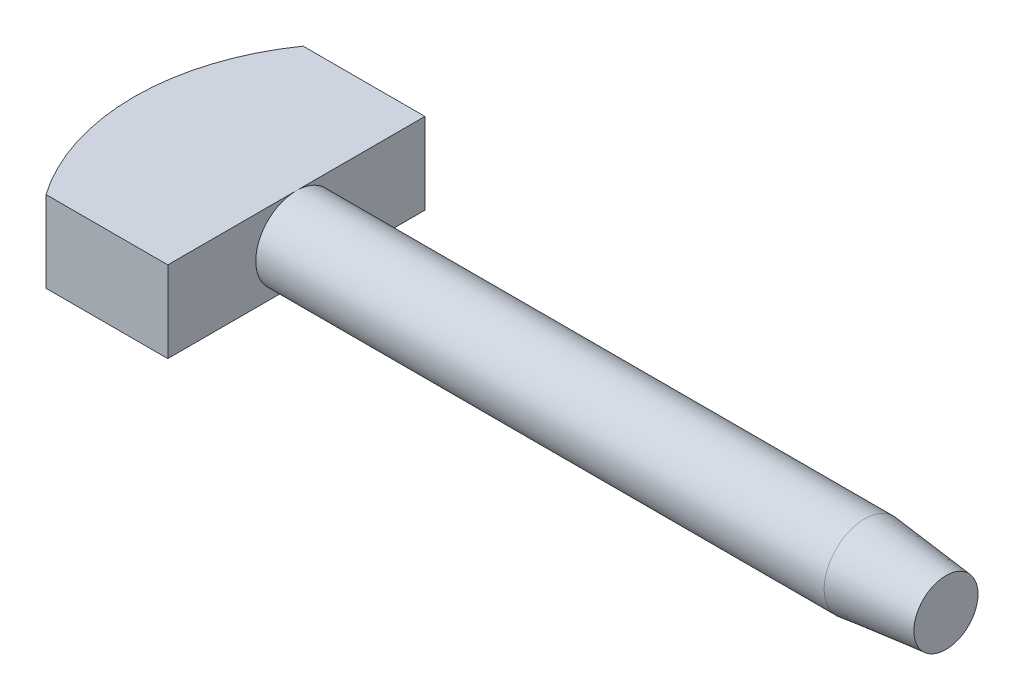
ISO-10303-21;
HEADER;
FILE_DESCRIPTION(('STEP AP214'),'2;1');
FILE_NAME('part.step','',(''),(''),'','','');
FILE_SCHEMA(('AUTOMOTIVE_DESIGN { 1 0 10303 214 1 1 1 1 }'));
ENDSEC;
DATA;
#1=APPLICATION_CONTEXT('core data for automotive mechanical design processes');
#2=APPLICATION_PROTOCOL_DEFINITION('international standard','automotive_design',2000,#1);
#3=PRODUCT_CONTEXT('',#1,'mechanical');
#4=PRODUCT('Part','Part','',(#3));
#5=PRODUCT_RELATED_PRODUCT_CATEGORY('part','',(#4));
#6=PRODUCT_DEFINITION_FORMATION('','',#4);
#7=PRODUCT_DEFINITION_CONTEXT('part definition',#1,'design');
#8=PRODUCT_DEFINITION('design','',#6,#7);
#9=PRODUCT_DEFINITION_SHAPE('','',#8);
#10=(LENGTH_UNIT() NAMED_UNIT(*) SI_UNIT(.MILLI.,.METRE.));
#11=(NAMED_UNIT(*) PLANE_ANGLE_UNIT() SI_UNIT($,.RADIAN.));
#12=(NAMED_UNIT(*) SI_UNIT($,.STERADIAN.) SOLID_ANGLE_UNIT());
#13=UNCERTAINTY_MEASURE_WITH_UNIT(LENGTH_MEASURE(1.E-05),#10,'distance_accuracy_value','');
#14=(GEOMETRIC_REPRESENTATION_CONTEXT(3) GLOBAL_UNCERTAINTY_ASSIGNED_CONTEXT((#13)) GLOBAL_UNIT_ASSIGNED_CONTEXT((#10,
#11,#12)) REPRESENTATION_CONTEXT('',''));
#15=CARTESIAN_POINT('',(0.,0.,0.));
#16=DIRECTION('',(0.,0.,1.));
#17=DIRECTION('',(1.,0.,0.));
#18=AXIS2_PLACEMENT_3D('',#15,#16,#17);
#19=CARTESIAN_POINT('',(24.,0.,0.));
#20=DIRECTION('',(-1.,0.,0.));
#21=DIRECTION('',(0.,0.,1.));
#22=AXIS2_PLACEMENT_3D('',#19,#20,#21);
#23=CYLINDRICAL_SURFACE('',#22,1.5);
#24=CARTESIAN_POINT('',(20.9999999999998,0.,0.));
#25=DIRECTION('',(1.,0.,0.));
#26=DIRECTION('',(0.,0.,-1.));
#27=AXIS2_PLACEMENT_3D('',#24,#25,#26);
#28=CIRCLE('',#27,1.5);
#29=CARTESIAN_POINT('',(20.9999999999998,0.,-1.5));
#30=VERTEX_POINT('',#29);
#31=EDGE_CURVE('E11',#30,#30,#28,.F.);
#32=ORIENTED_EDGE('',*,*,#31,.T.);
#33=EDGE_LOOP('',(#32));
#34=FACE_BOUND('',#33,.T.);
#35=CARTESIAN_POINT('',(0.,0.,0.));
#36=DIRECTION('',(1.,0.,0.));
#37=DIRECTION('',(0.,0.,-1.));
#38=AXIS2_PLACEMENT_3D('',#35,#36,#37);
#39=CIRCLE('',#38,1.5);
#40=CARTESIAN_POINT('',(0.,1.5,0.));
#41=VERTEX_POINT('',#40);
#42=CARTESIAN_POINT('',(0.,-1.5,0.));
#43=VERTEX_POINT('',#42);
#44=EDGE_CURVE('E118',#41,#43,#39,.T.);
#45=ORIENTED_EDGE('',*,*,#44,.T.);
#46=EDGE_CURVE('E53',#43,#41,#39,.T.);
#47=ORIENTED_EDGE('',*,*,#46,.T.);
#48=EDGE_LOOP('',(#45,#47));
#49=FACE_BOUND('',#48,.T.);
#50=ADVANCED_FACE('F31',(#34,#49),#23,.T.);
#51=CARTESIAN_POINT('',(24.,0.,0.));
#52=DIRECTION('',(1.,0.,0.));
#53=DIRECTION('',(0.,0.,-1.));
#54=AXIS2_PLACEMENT_3D('',#51,#52,#53);
#55=PLANE('',#54);
#56=CARTESIAN_POINT('',(24.,0.,0.));
#57=DIRECTION('',(1.,0.,0.));
#58=DIRECTION('',(0.,0.,-1.));
#59=AXIS2_PLACEMENT_3D('',#56,#57,#58);
#60=CIRCLE('',#59,1.18468729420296);
#61=CARTESIAN_POINT('',(24.,0.,-1.18468729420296));
#62=VERTEX_POINT('',#61);
#63=EDGE_CURVE('E39',#62,#62,#60,.T.);
#64=ORIENTED_EDGE('',*,*,#63,.T.);
#65=EDGE_LOOP('',(#64));
#66=FACE_BOUND('',#65,.T.);
#67=ADVANCED_FACE('F123',(#66),#55,.T.);
#68=CARTESIAN_POINT('',(24.,0.,0.));
#69=DIRECTION('',(-1.,0.,0.));
#70=DIRECTION('',(0.,0.,1.));
#71=AXIS2_PLACEMENT_3D('',#68,#69,#70);
#72=CONICAL_SURFACE('',#71,1.18468729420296,0.104719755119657);
#73=ORIENTED_EDGE('',*,*,#31,.F.);
#74=EDGE_LOOP('',(#73));
#75=FACE_BOUND('',#74,.T.);
#76=ORIENTED_EDGE('',*,*,#63,.F.);
#77=EDGE_LOOP('',(#76));
#78=FACE_BOUND('',#77,.T.);
#79=ADVANCED_FACE('F33',(#75,#78),#72,.T.);
#80=CARTESIAN_POINT('',(0.,-1.5,-4.75));
#81=DIRECTION('',(1.,0.,0.));
#82=DIRECTION('',(0.,0.,-1.));
#83=AXIS2_PLACEMENT_3D('',#80,#81,#82);
#84=PLANE('',#83);
#85=ORIENTED_EDGE('',*,*,#44,.F.);
#86=DIRECTION('',(0.,0.,-1.));
#87=VECTOR('',#86,1.);
#88=CARTESIAN_POINT('',(0.,1.5,-4.75));
#89=LINE('',#88,#87);
#90=CARTESIAN_POINT('',(0.,1.5,4.75));
#91=VERTEX_POINT('',#90);
#92=EDGE_CURVE('E46',#91,#41,#89,.T.);
#93=ORIENTED_EDGE('',*,*,#92,.F.);
#94=DIRECTION('',(0.,1.,0.));
#95=VECTOR('',#94,1.);
#96=CARTESIAN_POINT('',(0.,-1.5,4.75));
#97=LINE('',#96,#95);
#98=CARTESIAN_POINT('',(0.,-1.5,4.75));
#99=VERTEX_POINT('',#98);
#100=EDGE_CURVE('E113',#99,#91,#97,.T.);
#101=ORIENTED_EDGE('',*,*,#100,.F.);
#102=DIRECTION('',(0.,0.,-1.));
#103=VECTOR('',#102,1.);
#104=CARTESIAN_POINT('',(0.,-1.5,-4.75));
#105=LINE('',#104,#103);
#106=EDGE_CURVE('E103',#99,#43,#105,.T.);
#107=ORIENTED_EDGE('',*,*,#106,.T.);
#108=EDGE_LOOP('',(#85,#93,#101,#107));
#109=FACE_BOUND('',#108,.T.);
#110=ADVANCED_FACE('F126',(#109),#84,.T.);
#111=ORIENTED_EDGE('',*,*,#46,.F.);
#112=CARTESIAN_POINT('',(0.,-1.5,-4.75));
#113=VERTEX_POINT('',#112);
#114=EDGE_CURVE('E89',#43,#113,#105,.T.);
#115=ORIENTED_EDGE('',*,*,#114,.T.);
#116=DIRECTION('',(0.,1.,0.));
#117=VECTOR('',#116,1.);
#118=CARTESIAN_POINT('',(0.,-1.5,-4.75));
#119=LINE('',#118,#117);
#120=CARTESIAN_POINT('',(0.,1.5,-4.75));
#121=VERTEX_POINT('',#120);
#122=EDGE_CURVE('E87',#113,#121,#119,.T.);
#123=ORIENTED_EDGE('',*,*,#122,.T.);
#124=EDGE_CURVE('E77',#41,#121,#89,.T.);
#125=ORIENTED_EDGE('',*,*,#124,.F.);
#126=EDGE_LOOP('',(#111,#115,#123,#125));
#127=FACE_BOUND('',#126,.T.);
#128=ADVANCED_FACE('F88',(#127),#84,.T.);
#129=CARTESIAN_POINT('',(0.,-1.5,4.75));
#130=DIRECTION('',(0.,0.,1.));
#131=DIRECTION('',(1.,0.,0.));
#132=AXIS2_PLACEMENT_3D('',#129,#130,#131);
#133=PLANE('',#132);
#134=ORIENTED_EDGE('',*,*,#100,.T.);
#135=DIRECTION('',(1.,0.,0.));
#136=VECTOR('',#135,1.);
#137=CARTESIAN_POINT('',(0.,1.5,4.75));
#138=LINE('',#137,#136);
#139=CARTESIAN_POINT('',(-4.5,1.5,4.75));
#140=VERTEX_POINT('',#139);
#141=EDGE_CURVE('E99',#140,#91,#138,.T.);
#142=ORIENTED_EDGE('',*,*,#141,.F.);
#143=DIRECTION('',(0.,1.,0.));
#144=VECTOR('',#143,1.);
#145=CARTESIAN_POINT('',(-4.5,-1.5,4.75));
#146=LINE('',#145,#144);
#147=CARTESIAN_POINT('',(-4.5,-1.5,4.75));
#148=VERTEX_POINT('',#147);
#149=EDGE_CURVE('E115',#148,#140,#146,.T.);
#150=ORIENTED_EDGE('',*,*,#149,.F.);
#151=DIRECTION('',(1.,0.,0.));
#152=VECTOR('',#151,1.);
#153=CARTESIAN_POINT('',(0.,-1.5,4.75));
#154=LINE('',#153,#152);
#155=EDGE_CURVE('E94',#148,#99,#154,.T.);
#156=ORIENTED_EDGE('',*,*,#155,.T.);
#157=EDGE_LOOP('',(#134,#142,#150,#156));
#158=FACE_BOUND('',#157,.T.);
#159=ADVANCED_FACE('F148',(#158),#133,.T.);
#160=CARTESIAN_POINT('',(2.27083333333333,-1.5,0.));
#161=DIRECTION('',(0.,1.,0.));
#162=DIRECTION('',(0.,0.,1.));
#163=AXIS2_PLACEMENT_3D('',#160,#161,#162);
#164=CYLINDRICAL_SURFACE('',#163,8.27083333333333);
#165=ORIENTED_EDGE('',*,*,#149,.T.);
#166=CARTESIAN_POINT('',(2.27083333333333,1.5,0.));
#167=DIRECTION('',(0.,1.,0.));
#168=DIRECTION('',(0.,0.,1.));
#169=AXIS2_PLACEMENT_3D('',#166,#167,#168);
#170=CIRCLE('',#169,8.27083333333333);
#171=CARTESIAN_POINT('',(-4.5,1.5,-4.75));
#172=VERTEX_POINT('',#171);
#173=EDGE_CURVE('E97',#172,#140,#170,.T.);
#174=ORIENTED_EDGE('',*,*,#173,.F.);
#175=DIRECTION('',(0.,1.,0.));
#176=VECTOR('',#175,1.);
#177=CARTESIAN_POINT('',(-4.5,-1.5,-4.75));
#178=LINE('',#177,#176);
#179=CARTESIAN_POINT('',(-4.5,-1.5,-4.75));
#180=VERTEX_POINT('',#179);
#181=EDGE_CURVE('E93',#180,#172,#178,.T.);
#182=ORIENTED_EDGE('',*,*,#181,.F.);
#183=CARTESIAN_POINT('',(2.27083333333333,-1.5,0.));
#184=DIRECTION('',(0.,1.,0.));
#185=DIRECTION('',(0.,0.,1.));
#186=AXIS2_PLACEMENT_3D('',#183,#184,#185);
#187=CIRCLE('',#186,8.27083333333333);
#188=EDGE_CURVE('E108',#180,#148,#187,.T.);
#189=ORIENTED_EDGE('',*,*,#188,.T.);
#190=EDGE_LOOP('',(#165,#174,#182,#189));
#191=FACE_BOUND('',#190,.T.);
#192=ADVANCED_FACE('F145',(#191),#164,.T.);
#193=CARTESIAN_POINT('',(0.,-1.5,-4.75));
#194=DIRECTION('',(0.,0.,-1.));
#195=DIRECTION('',(-1.,0.,0.));
#196=AXIS2_PLACEMENT_3D('',#193,#194,#195);
#197=PLANE('',#196);
#198=ORIENTED_EDGE('',*,*,#181,.T.);
#199=DIRECTION('',(-1.,0.,0.));
#200=VECTOR('',#199,1.);
#201=CARTESIAN_POINT('',(0.,1.5,-4.75));
#202=LINE('',#201,#200);
#203=EDGE_CURVE('E82',#121,#172,#202,.T.);
#204=ORIENTED_EDGE('',*,*,#203,.F.);
#205=ORIENTED_EDGE('',*,*,#122,.F.);
#206=DIRECTION('',(-1.,0.,0.));
#207=VECTOR('',#206,1.);
#208=CARTESIAN_POINT('',(0.,-1.5,-4.75));
#209=LINE('',#208,#207);
#210=EDGE_CURVE('E106',#113,#180,#209,.T.);
#211=ORIENTED_EDGE('',*,*,#210,.T.);
#212=EDGE_LOOP('',(#198,#204,#205,#211));
#213=FACE_BOUND('',#212,.T.);
#214=ADVANCED_FACE('F96',(#213),#197,.T.);
#215=CARTESIAN_POINT('',(2.27083333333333,-1.5,0.));
#216=DIRECTION('',(0.,1.,0.));
#217=DIRECTION('',(0.,0.,1.));
#218=AXIS2_PLACEMENT_3D('',#215,#216,#217);
#219=PLANE('',#218);
#220=ORIENTED_EDGE('',*,*,#106,.F.);
#221=ORIENTED_EDGE('',*,*,#155,.F.);
#222=ORIENTED_EDGE('',*,*,#188,.F.);
#223=ORIENTED_EDGE('',*,*,#210,.F.);
#224=ORIENTED_EDGE('',*,*,#114,.F.);
#225=EDGE_LOOP('',(#220,#221,#222,#223,#224));
#226=FACE_BOUND('',#225,.T.);
#227=ADVANCED_FACE('F144',(#226),#219,.F.);
#228=CARTESIAN_POINT('',(2.27083333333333,1.5,0.));
#229=DIRECTION('',(0.,1.,0.));
#230=DIRECTION('',(0.,0.,1.));
#231=AXIS2_PLACEMENT_3D('',#228,#229,#230);
#232=PLANE('',#231);
#233=ORIENTED_EDGE('',*,*,#92,.T.);
#234=ORIENTED_EDGE('',*,*,#124,.T.);
#235=ORIENTED_EDGE('',*,*,#203,.T.);
#236=ORIENTED_EDGE('',*,*,#173,.T.);
#237=ORIENTED_EDGE('',*,*,#141,.T.);
#238=EDGE_LOOP('',(#233,#234,#235,#236,#237));
#239=FACE_BOUND('',#238,.T.);
#240=ADVANCED_FACE('F79',(#239),#232,.T.);
#241=CLOSED_SHELL('',(#50,#67,#79,#110,#128,#159,#192,#214,#227,#240));
#242=MANIFOLD_SOLID_BREP('B2',#241);
#243=ADVANCED_BREP_SHAPE_REPRESENTATION('',(#18,#242),#14);
#244=SHAPE_DEFINITION_REPRESENTATION(#9,#243);
ENDSEC;
END-ISO-10303-21;
